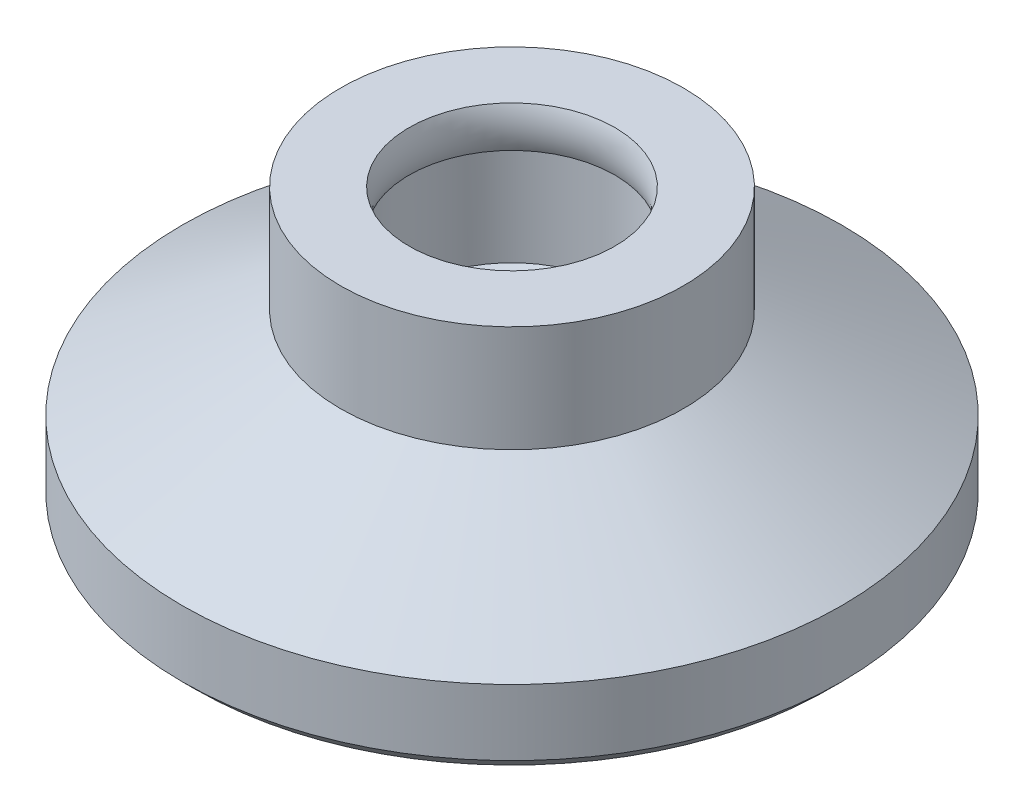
from build123d import *

# Parameters (mm, degrees)
SKETCH1_R      = 6.5
EXTRUDE1_DEPTH = 5.25
SKETCH3_R      = 12.5
EXTRUDE2_DEPTH = 3
CHAMFER1_SIZE  = 0.5


with BuildPart() as part:
    # Sketch1 → Extrude1 (new, symmetric)
    with BuildSketch(Plane(origin=(0, 0, 0), x_dir=(1, 0, 0), z_dir=(0, 1, 0))):
        with Locations(Location((0, 0, 0), (0, 0, 90))):
            Circle(SKETCH1_R)
    extrude(amount=EXTRUDE1_DEPTH, both=True)

    # Sketch3 → Extrude2 (add)
    with BuildSketch(Plane.XZ.offset(5.25)):
        with Locations(Location((0, 0, 0), (0, 0, 270))):
            Circle(SKETCH3_R)
    extrude(amount=-EXTRUDE2_DEPTH)

    # Sketch4 → Revolve1 (revolve)
    with BuildSketch(Plane.XY, mode=Mode.PRIVATE) as revolve1_sk:
        Polygon((-12.5, -2.25), (-6.5, 1.214101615), (-6.5, -2.25), align=None)
    revolve(revolve1_sk.sketch.rotate(Axis((0, 5.25, 0), (0, -1, 0)), 90), axis=Axis((0, 5.25, 0), (0, -1, 0)))

    # Chamfer1
    chamfer1_edges = [part.edges().sort_by_distance(p)[0] for p in [
        (0, -5.25, 12.5),
    ]]
    chamfer(chamfer1_edges, length=CHAMFER1_SIZE)

    # Sketch5 → Cut-Revolve1 (revolve, cut)
    with BuildSketch(Plane.XY, mode=Mode.PRIVATE) as cut_revolve1_sk:
        with BuildLine():
            Line((0, 5.25), (3.9, 5.25))
            ThreePointArc((3.9, 5.25), (3.744, 4.47), (3.9, 3.69))
            Line((3.9, 3.69), (3.9, 0.00166605))
            Line((3.9, 0.00166605), (0, -2.25))
            Line((0, -2.25), (0, 5.25))
        make_face()
    revolve(cut_revolve1_sk.sketch.rotate(Axis((0, 0, 0), (0, 1, 0)), 270), axis=Axis((0, 0, 0), (0, 1, 0)), mode=Mode.SUBTRACT)


solid = part.part
